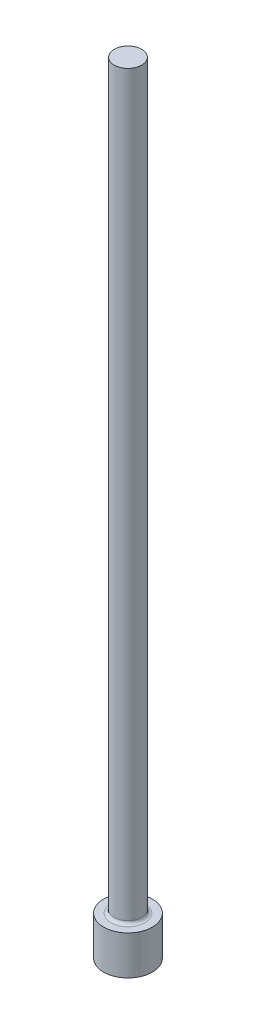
from build123d import *


with BuildPart() as part:
    # Sketch1 → Revolve3 (revolve)
    with BuildSketch(Plane.XY, mode=Mode.PRIVATE) as revolve3_sk:
        with BuildLine():
            Line((0, 0), (1.9812, 0))
            Line((1.9812, 0), (1.9812, 3.175))
            Line((1.9812, 3.175), (1.3716, 3.175))
            ThreePointArc((1.3716, 3.175), (1.191994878, 3.249394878), (1.1176, 3.429))
            Line((1.1176, 3.429), (1.1176, 63.5))
            Line((1.1176, 63.5), (0, 63.5))
            Line((0, 63.5), (0, 0))
        make_face()
    revolve(revolve3_sk.sketch.rotate(Axis((0, 0, 0), (0, -1, 0)), 90), axis=Axis((0, 0, 0), (0, -1, 0)))


solid = part.part
